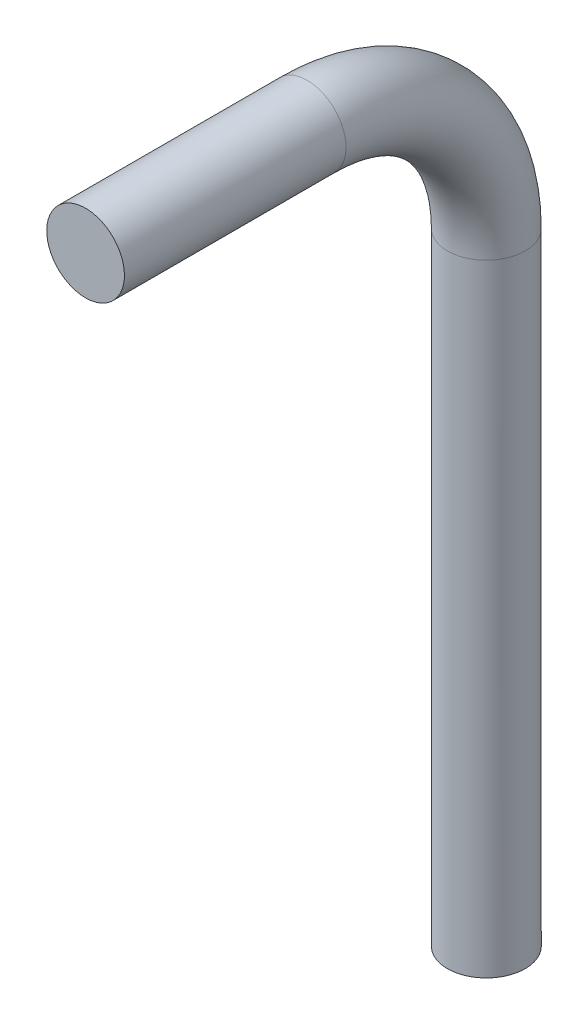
from build123d import *

# Parameters (mm, degrees)
SKETCH1_R = 25.4


with BuildPart() as part:
    # Sweep1: sweep along a path in Sketch2
    with BuildLine(Plane(origin=(0, 0, 0), x_dir=(0, 0, -1), z_dir=(1, 0, 0))) as sweep1_path:
        Line((0, 0), (0, 406.4))
        ThreePointArc((0, 406.4), (-34.304000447, 489.217183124), (-117.121183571, 523.521183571))
        Line((-117.121183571, 523.521183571), (-261.998667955, 523.521183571))
    # Sketch1 → Sweep1 (sweep)
    with BuildSketch(Plane(origin=(0, 0, 0), x_dir=(1, 0, 0), z_dir=(0, 1, 0))):
        Circle(SKETCH1_R)
    sweep(path=sweep1_path.line)


solid = part.part
